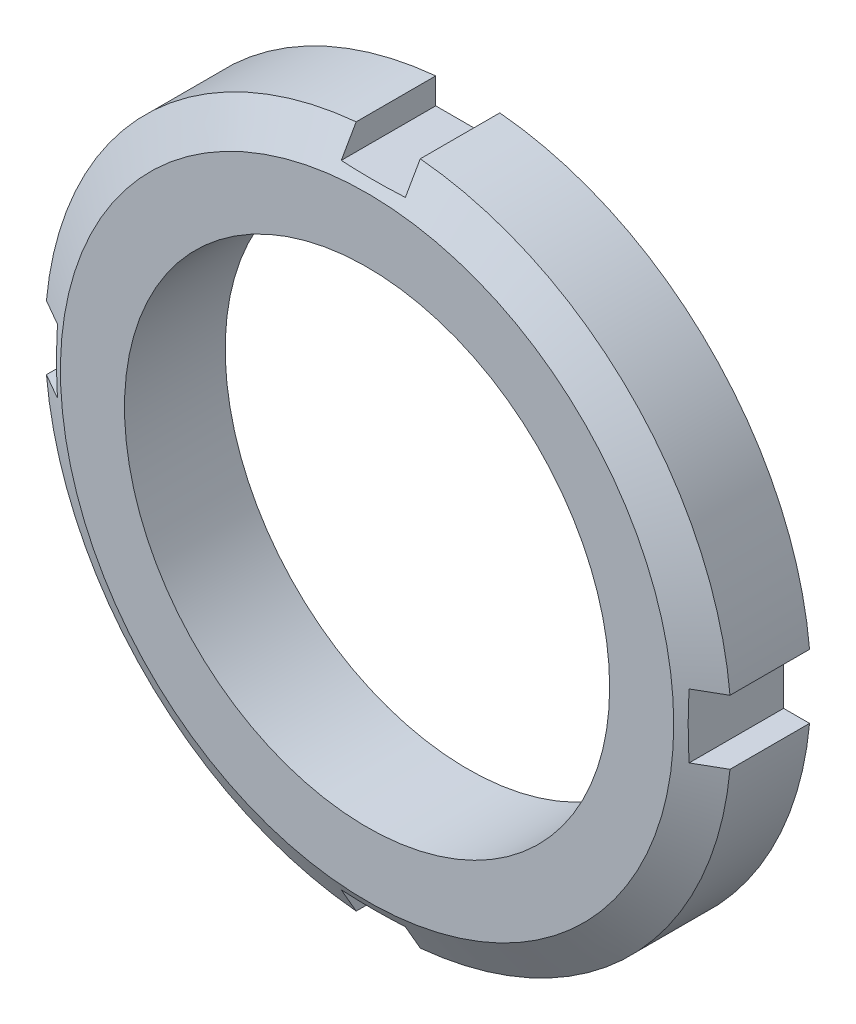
ISO-10303-21;
HEADER;
FILE_DESCRIPTION(('STEP AP214'),'2;1');
FILE_NAME('part.step','',(''),(''),'','','');
FILE_SCHEMA(('AUTOMOTIVE_DESIGN { 1 0 10303 214 1 1 1 1 }'));
ENDSEC;
DATA;
#1=APPLICATION_CONTEXT('core data for automotive mechanical design processes');
#2=APPLICATION_PROTOCOL_DEFINITION('international standard','automotive_design',2000,#1);
#3=PRODUCT_CONTEXT('',#1,'mechanical');
#4=PRODUCT('Part','Part','',(#3));
#5=PRODUCT_RELATED_PRODUCT_CATEGORY('part','',(#4));
#6=PRODUCT_DEFINITION_FORMATION('','',#4);
#7=PRODUCT_DEFINITION_CONTEXT('part definition',#1,'design');
#8=PRODUCT_DEFINITION('design','',#6,#7);
#9=PRODUCT_DEFINITION_SHAPE('','',#8);
#10=(LENGTH_UNIT() NAMED_UNIT(*) SI_UNIT(.MILLI.,.METRE.));
#11=(NAMED_UNIT(*) PLANE_ANGLE_UNIT() SI_UNIT($,.RADIAN.));
#12=(NAMED_UNIT(*) SI_UNIT($,.STERADIAN.) SOLID_ANGLE_UNIT());
#13=UNCERTAINTY_MEASURE_WITH_UNIT(LENGTH_MEASURE(1.E-05),#10,'distance_accuracy_value','');
#14=(GEOMETRIC_REPRESENTATION_CONTEXT(3) GLOBAL_UNCERTAINTY_ASSIGNED_CONTEXT((#13)) GLOBAL_UNIT_ASSIGNED_CONTEXT((#10,
#11,#12)) REPRESENTATION_CONTEXT('',''));
#15=CARTESIAN_POINT('',(0.,0.,0.));
#16=DIRECTION('',(0.,0.,1.));
#17=DIRECTION('',(1.,0.,0.));
#18=AXIS2_PLACEMENT_3D('',#15,#16,#17);
#19=CARTESIAN_POINT('',(0.,0.,11.));
#20=DIRECTION('',(0.,0.,-1.));
#21=DIRECTION('',(-1.,0.,0.));
#22=AXIS2_PLACEMENT_3D('',#19,#20,#21);
#23=CYLINDRICAL_SURFACE('',#22,37.5);
#24=CARTESIAN_POINT('',(0.,0.,8.6905989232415));
#25=DIRECTION('',(0.,0.,1.));
#26=DIRECTION('',(1.,0.,0.));
#27=AXIS2_PLACEMENT_3D('',#24,#25,#26);
#28=CIRCLE('',#27,37.5);
#29=CARTESIAN_POINT('',(-37.3363094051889,3.50000000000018,8.6905989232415));
#30=VERTEX_POINT('',#29);
#31=CARTESIAN_POINT('',(-3.49999999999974,37.336309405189,8.6905989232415));
#32=VERTEX_POINT('',#31);
#33=EDGE_CURVE('E763',#30,#32,#28,.F.);
#34=ORIENTED_EDGE('',*,*,#33,.T.);
#35=DIRECTION('',(0.,0.,-1.));
#36=VECTOR('',#35,1.);
#37=CARTESIAN_POINT('',(-3.49999999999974,37.336309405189,11.));
#38=LINE('',#37,#36);
#39=CARTESIAN_POINT('',(-3.49999999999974,37.336309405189,0.));
#40=VERTEX_POINT('',#39);
#41=EDGE_CURVE('E578',#32,#40,#38,.T.);
#42=ORIENTED_EDGE('',*,*,#41,.T.);
#43=CARTESIAN_POINT('',(0.,0.,0.));
#44=DIRECTION('',(0.,0.,1.));
#45=DIRECTION('',(1.,0.,0.));
#46=AXIS2_PLACEMENT_3D('',#43,#44,#45);
#47=CIRCLE('',#46,37.5);
#48=CARTESIAN_POINT('',(-37.3363094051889,3.50000000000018,0.));
#49=VERTEX_POINT('',#48);
#50=EDGE_CURVE('E643',#40,#49,#47,.T.);
#51=ORIENTED_EDGE('',*,*,#50,.T.);
#52=DIRECTION('',(0.,0.,-1.));
#53=VECTOR('',#52,1.);
#54=CARTESIAN_POINT('',(-37.3363094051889,3.50000000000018,11.));
#55=LINE('',#54,#53);
#56=EDGE_CURVE('E590',#49,#30,#55,.F.);
#57=ORIENTED_EDGE('',*,*,#56,.T.);
#58=EDGE_LOOP('',(#34,#42,#51,#57));
#59=FACE_BOUND('',#58,.T.);
#60=ADVANCED_FACE('F435',(#59),#23,.T.);
#61=CARTESIAN_POINT('',(-3.50000000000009,-37.3363094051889,8.6905989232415));
#62=VERTEX_POINT('',#61);
#63=CARTESIAN_POINT('',(-37.336309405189,-3.49999999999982,8.6905989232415));
#64=VERTEX_POINT('',#63);
#65=EDGE_CURVE('E651',#62,#64,#28,.F.);
#66=ORIENTED_EDGE('',*,*,#65,.T.);
#67=DIRECTION('',(0.,0.,-1.));
#68=VECTOR('',#67,1.);
#69=CARTESIAN_POINT('',(-37.336309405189,-3.49999999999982,11.));
#70=LINE('',#69,#68);
#71=CARTESIAN_POINT('',(-37.336309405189,-3.49999999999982,0.));
#72=VERTEX_POINT('',#71);
#73=EDGE_CURVE('E594',#64,#72,#70,.T.);
#74=ORIENTED_EDGE('',*,*,#73,.T.);
#75=CARTESIAN_POINT('',(-3.50000000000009,-37.3363094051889,0.));
#76=VERTEX_POINT('',#75);
#77=EDGE_CURVE('E784',#72,#76,#47,.T.);
#78=ORIENTED_EDGE('',*,*,#77,.T.);
#79=DIRECTION('',(0.,0.,-1.));
#80=VECTOR('',#79,1.);
#81=CARTESIAN_POINT('',(-3.50000000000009,-37.3363094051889,11.));
#82=LINE('',#81,#80);
#83=EDGE_CURVE('E608',#76,#62,#82,.F.);
#84=ORIENTED_EDGE('',*,*,#83,.T.);
#85=EDGE_LOOP('',(#66,#74,#78,#84));
#86=FACE_BOUND('',#85,.T.);
#87=ADVANCED_FACE('F770',(#86),#23,.T.);
#88=CARTESIAN_POINT('',(37.3363094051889,-3.5,8.6905989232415));
#89=VERTEX_POINT('',#88);
#90=CARTESIAN_POINT('',(3.49999999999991,-37.3363094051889,8.6905989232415));
#91=VERTEX_POINT('',#90);
#92=EDGE_CURVE('E647',#89,#91,#28,.F.);
#93=ORIENTED_EDGE('',*,*,#92,.T.);
#94=DIRECTION('',(0.,0.,-1.));
#95=VECTOR('',#94,1.);
#96=CARTESIAN_POINT('',(3.49999999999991,-37.3363094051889,11.));
#97=LINE('',#96,#95);
#98=CARTESIAN_POINT('',(3.49999999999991,-37.3363094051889,0.));
#99=VERTEX_POINT('',#98);
#100=EDGE_CURVE('E612',#91,#99,#97,.T.);
#101=ORIENTED_EDGE('',*,*,#100,.T.);
#102=CARTESIAN_POINT('',(37.3363094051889,-3.5,0.));
#103=VERTEX_POINT('',#102);
#104=EDGE_CURVE('E639',#99,#103,#47,.T.);
#105=ORIENTED_EDGE('',*,*,#104,.T.);
#106=DIRECTION('',(0.,0.,-1.));
#107=VECTOR('',#106,1.);
#108=CARTESIAN_POINT('',(37.3363094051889,-3.5,11.));
#109=LINE('',#108,#107);
#110=EDGE_CURVE('E626',#103,#89,#109,.F.);
#111=ORIENTED_EDGE('',*,*,#110,.T.);
#112=EDGE_LOOP('',(#93,#101,#105,#111));
#113=FACE_BOUND('',#112,.T.);
#114=ADVANCED_FACE('F789',(#113),#23,.T.);
#115=CARTESIAN_POINT('',(0.,0.,11.));
#116=DIRECTION('',(0.,0.,1.));
#117=DIRECTION('',(1.,0.,0.));
#118=AXIS2_PLACEMENT_3D('',#115,#116,#117);
#119=PLANE('',#118);
#120=CARTESIAN_POINT('',(0.,0.,11.));
#121=DIRECTION('',(0.,0.,1.));
#122=DIRECTION('',(1.,0.,0.));
#123=AXIS2_PLACEMENT_3D('',#120,#121,#122);
#124=CIRCLE('',#123,33.5);
#125=CARTESIAN_POINT('',(33.5,0.,11.));
#126=VERTEX_POINT('',#125);
#127=EDGE_CURVE('E642',#126,#126,#124,.T.);
#128=ORIENTED_EDGE('',*,*,#127,.T.);
#129=EDGE_LOOP('',(#128));
#130=FACE_BOUND('',#129,.T.);
#131=CARTESIAN_POINT('',(0.,0.,11.));
#132=DIRECTION('',(0.,0.,1.));
#133=DIRECTION('',(1.,0.,0.));
#134=AXIS2_PLACEMENT_3D('',#131,#132,#133);
#135=CIRCLE('',#134,26.5);
#136=CARTESIAN_POINT('',(26.5,0.,11.));
#137=VERTEX_POINT('',#136);
#138=EDGE_CURVE('E636',#137,#137,#135,.T.);
#139=ORIENTED_EDGE('',*,*,#138,.F.);
#140=EDGE_LOOP('',(#139));
#141=FACE_BOUND('',#140,.T.);
#142=ADVANCED_FACE('F816',(#130,#141),#119,.T.);
#143=CARTESIAN_POINT('',(0.,0.,0.));
#144=DIRECTION('',(0.,0.,1.));
#145=DIRECTION('',(1.,0.,0.));
#146=AXIS2_PLACEMENT_3D('',#143,#144,#145);
#147=PLANE('',#146);
#148=ORIENTED_EDGE('',*,*,#50,.F.);
#149=DIRECTION('',(0.,1.,0.));
#150=VECTOR('',#149,1.);
#151=CARTESIAN_POINT('',(-3.49999999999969,44.5,0.));
#152=LINE('',#151,#150);
#153=CARTESIAN_POINT('',(-3.49999999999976,34.5,0.));
#154=VERTEX_POINT('',#153);
#155=EDGE_CURVE('E559',#154,#40,#152,.T.);
#156=ORIENTED_EDGE('',*,*,#155,.F.);
#157=DIRECTION('',(-1.,0.,0.));
#158=VECTOR('',#157,1.);
#159=CARTESIAN_POINT('',(-3.49999999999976,34.5,0.));
#160=LINE('',#159,#158);
#161=CARTESIAN_POINT('',(3.50000000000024,34.5,0.));
#162=VERTEX_POINT('',#161);
#163=EDGE_CURVE('E554',#162,#154,#160,.T.);
#164=ORIENTED_EDGE('',*,*,#163,.F.);
#165=DIRECTION('',(0.,-1.,0.));
#166=VECTOR('',#165,1.);
#167=CARTESIAN_POINT('',(3.50000000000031,44.5,0.));
#168=LINE('',#167,#166);
#169=CARTESIAN_POINT('',(3.50000000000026,37.3363094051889,0.));
#170=VERTEX_POINT('',#169);
#171=EDGE_CURVE('E562',#170,#162,#168,.T.);
#172=ORIENTED_EDGE('',*,*,#171,.F.);
#173=CARTESIAN_POINT('',(37.3363094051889,3.5,0.));
#174=VERTEX_POINT('',#173);
#175=EDGE_CURVE('E640',#174,#170,#47,.T.);
#176=ORIENTED_EDGE('',*,*,#175,.F.);
#177=DIRECTION('',(1.,0.,0.));
#178=VECTOR('',#177,1.);
#179=CARTESIAN_POINT('',(44.5,3.5,0.));
#180=LINE('',#179,#178);
#181=CARTESIAN_POINT('',(34.5,3.5,0.));
#182=VERTEX_POINT('',#181);
#183=EDGE_CURVE('E621',#182,#174,#180,.T.);
#184=ORIENTED_EDGE('',*,*,#183,.F.);
#185=DIRECTION('',(0.,1.,0.));
#186=VECTOR('',#185,1.);
#187=CARTESIAN_POINT('',(34.5,3.5,0.));
#188=LINE('',#187,#186);
#189=CARTESIAN_POINT('',(34.5,-3.5,0.));
#190=VERTEX_POINT('',#189);
#191=EDGE_CURVE('E618',#190,#182,#188,.T.);
#192=ORIENTED_EDGE('',*,*,#191,.F.);
#193=DIRECTION('',(-1.,0.,0.));
#194=VECTOR('',#193,1.);
#195=CARTESIAN_POINT('',(44.5,-3.5,0.));
#196=LINE('',#195,#194);
#197=EDGE_CURVE('E615',#103,#190,#196,.T.);
#198=ORIENTED_EDGE('',*,*,#197,.F.);
#199=ORIENTED_EDGE('',*,*,#104,.F.);
#200=DIRECTION('',(0.,-1.,0.));
#201=VECTOR('',#200,1.);
#202=CARTESIAN_POINT('',(3.49999999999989,-44.5,0.));
#203=LINE('',#202,#201);
#204=CARTESIAN_POINT('',(3.49999999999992,-34.5,0.));
#205=VERTEX_POINT('',#204);
#206=EDGE_CURVE('E603',#205,#99,#203,.T.);
#207=ORIENTED_EDGE('',*,*,#206,.F.);
#208=DIRECTION('',(1.,0.,0.));
#209=VECTOR('',#208,1.);
#210=CARTESIAN_POINT('',(3.49999999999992,-34.5,0.));
#211=LINE('',#210,#209);
#212=CARTESIAN_POINT('',(-3.50000000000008,-34.5,0.));
#213=VERTEX_POINT('',#212);
#214=EDGE_CURVE('E600',#213,#205,#211,.T.);
#215=ORIENTED_EDGE('',*,*,#214,.F.);
#216=DIRECTION('',(0.,1.,0.));
#217=VECTOR('',#216,1.);
#218=CARTESIAN_POINT('',(-3.50000000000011,-44.5,0.));
#219=LINE('',#218,#217);
#220=EDGE_CURVE('E597',#76,#213,#219,.T.);
#221=ORIENTED_EDGE('',*,*,#220,.F.);
#222=ORIENTED_EDGE('',*,*,#77,.F.);
#223=DIRECTION('',(-1.,0.,0.));
#224=VECTOR('',#223,1.);
#225=CARTESIAN_POINT('',(-44.5,-3.49999999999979,0.));
#226=LINE('',#225,#224);
#227=CARTESIAN_POINT('',(-34.5,-3.49999999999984,0.));
#228=VERTEX_POINT('',#227);
#229=EDGE_CURVE('E586',#228,#72,#226,.T.);
#230=ORIENTED_EDGE('',*,*,#229,.F.);
#231=DIRECTION('',(0.,-1.,0.));
#232=VECTOR('',#231,1.);
#233=CARTESIAN_POINT('',(-34.5,-3.49999999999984,0.));
#234=LINE('',#233,#232);
#235=CARTESIAN_POINT('',(-34.5,3.50000000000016,0.));
#236=VERTEX_POINT('',#235);
#237=EDGE_CURVE('E583',#236,#228,#234,.T.);
#238=ORIENTED_EDGE('',*,*,#237,.F.);
#239=DIRECTION('',(1.,0.,0.));
#240=VECTOR('',#239,1.);
#241=CARTESIAN_POINT('',(-44.5,3.50000000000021,0.));
#242=LINE('',#241,#240);
#243=EDGE_CURVE('E581',#49,#236,#242,.T.);
#244=ORIENTED_EDGE('',*,*,#243,.F.);
#245=EDGE_LOOP('',(#148,#156,#164,#172,#176,#184,#192,#198,#199,#207,#215,#221,#222,#230,#238,#244));
#246=FACE_BOUND('',#245,.T.);
#247=CARTESIAN_POINT('',(0.,0.,0.));
#248=DIRECTION('',(0.,0.,1.));
#249=DIRECTION('',(1.,0.,0.));
#250=AXIS2_PLACEMENT_3D('',#247,#248,#249);
#251=CIRCLE('',#250,26.5);
#252=CARTESIAN_POINT('',(26.5,0.,0.));
#253=VERTEX_POINT('',#252);
#254=EDGE_CURVE('E633',#253,#253,#251,.T.);
#255=ORIENTED_EDGE('',*,*,#254,.T.);
#256=EDGE_LOOP('',(#255));
#257=FACE_BOUND('',#256,.T.);
#258=ADVANCED_FACE('F571',(#246,#257),#147,.F.);
#259=ORIENTED_EDGE('',*,*,#175,.T.);
#260=DIRECTION('',(0.,0.,-1.));
#261=VECTOR('',#260,1.);
#262=CARTESIAN_POINT('',(3.50000000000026,37.3363094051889,11.));
#263=LINE('',#262,#261);
#264=CARTESIAN_POINT('',(3.50000000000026,37.3363094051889,8.6905989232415));
#265=VERTEX_POINT('',#264);
#266=EDGE_CURVE('E565',#170,#265,#263,.F.);
#267=ORIENTED_EDGE('',*,*,#266,.T.);
#268=CARTESIAN_POINT('',(37.3363094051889,3.5,8.6905989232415));
#269=VERTEX_POINT('',#268);
#270=EDGE_CURVE('E646',#265,#269,#28,.F.);
#271=ORIENTED_EDGE('',*,*,#270,.T.);
#272=DIRECTION('',(0.,0.,-1.));
#273=VECTOR('',#272,1.);
#274=CARTESIAN_POINT('',(37.3363094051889,3.5,11.));
#275=LINE('',#274,#273);
#276=EDGE_CURVE('E630',#269,#174,#275,.T.);
#277=ORIENTED_EDGE('',*,*,#276,.T.);
#278=EDGE_LOOP('',(#259,#267,#271,#277));
#279=FACE_BOUND('',#278,.T.);
#280=ADVANCED_FACE('F437',(#279),#23,.T.);
#281=CARTESIAN_POINT('',(0.,0.,11.));
#282=DIRECTION('',(0.,0.,-1.));
#283=DIRECTION('',(-1.,0.,0.));
#284=AXIS2_PLACEMENT_3D('',#281,#282,#283);
#285=CYLINDRICAL_SURFACE('',#284,26.5);
#286=ORIENTED_EDGE('',*,*,#138,.T.);
#287=EDGE_LOOP('',(#286));
#288=FACE_BOUND('',#287,.T.);
#289=ORIENTED_EDGE('',*,*,#254,.F.);
#290=EDGE_LOOP('',(#289));
#291=FACE_BOUND('',#290,.T.);
#292=ADVANCED_FACE('F809',(#288,#291),#285,.F.);
#293=CARTESIAN_POINT('',(0.,0.,11.));
#294=DIRECTION('',(0.,0.,-1.));
#295=DIRECTION('',(-1.,0.,0.));
#296=AXIS2_PLACEMENT_3D('',#293,#294,#295);
#297=CONICAL_SURFACE('',#296,33.5,1.0471975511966);
#298=CARTESIAN_POINT('',(-3.49999999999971,42.0118932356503,6.00162861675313));
#299=CARTESIAN_POINT('',(-3.49999999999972,40.9768039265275,6.59717037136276));
#300=CARTESIAN_POINT('',(-3.49999999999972,39.9416526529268,7.19260446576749));
#301=CARTESIAN_POINT('',(-3.49999999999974,37.8711843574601,8.38318408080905));
#302=CARTESIAN_POINT('',(-3.49999999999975,36.8358673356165,8.97832960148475));
#303=CARTESIAN_POINT('',(-3.49999999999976,34.7650253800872,10.1682590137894));
#304=CARTESIAN_POINT('',(-3.49999999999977,33.7295004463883,10.7630429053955));
#305=CARTESIAN_POINT('',(-3.49999999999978,31.6581715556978,11.9521249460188));
#306=CARTESIAN_POINT('',(-3.49999999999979,30.6223675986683,12.54642309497));
#307=CARTESIAN_POINT('',(-3.4999999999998,29.586388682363,13.140416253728));
#308=B_SPLINE_CURVE_WITH_KNOTS('',3,(#298,#299,#300,#301,#302,#303,#304,#305,#306,#307),
.UNSPECIFIED.,.F.,.F.,(4,2,2,2,4),(0.,3.58255758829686,7.16511469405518,10.7476720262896,
14.3302298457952),.UNSPECIFIED.);
#309=CARTESIAN_POINT('',(-3.49999999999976,34.5,10.3204115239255));
#310=VERTEX_POINT('',#309);
#311=EDGE_CURVE('E11',#32,#310,#308,.T.);
#312=ORIENTED_EDGE('',*,*,#311,.F.);
#313=ORIENTED_EDGE('',*,*,#33,.F.);
#314=CARTESIAN_POINT('',(-30.7145568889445,3.50000000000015,12.49341431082));
#315=CARTESIAN_POINT('',(-31.7504089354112,3.50000000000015,11.8992000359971));
#316=CARTESIAN_POINT('',(-32.7861038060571,3.50000000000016,11.3047118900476));
#317=CARTESIAN_POINT('',(-34.8572413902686,3.50000000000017,10.1152967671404));
#318=CARTESIAN_POINT('',(-35.8926841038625,3.50000000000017,9.52036979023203));
#319=CARTESIAN_POINT('',(-37.9633797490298,3.50000000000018,8.33018581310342));
#320=CARTESIAN_POINT('',(-38.9986326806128,3.50000000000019,7.73492881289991));
#321=CARTESIAN_POINT('',(-41.0689863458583,3.5000000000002,6.5441499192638));
#322=CARTESIAN_POINT('',(-42.1040870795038,3.5000000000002,5.94862802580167));
#323=CARTESIAN_POINT('',(-43.1391303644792,3.50000000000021,5.35300633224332));
#324=B_SPLINE_CURVE_WITH_KNOTS('',3,(#314,#315,#316,#317,#318,#319,#320,#321,#322,#323),
.UNSPECIFIED.,.F.,.F.,(4,2,2,2,4),(0.,3.58255770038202,7.16511499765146,10.7476721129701,
14.330229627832),.UNSPECIFIED.);
#325=CARTESIAN_POINT('',(-34.5,3.50000000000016,10.3204115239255));
#326=VERTEX_POINT('',#325);
#327=EDGE_CURVE('E722',#326,#30,#324,.T.);
#328=ORIENTED_EDGE('',*,*,#327,.F.);
#329=CARTESIAN_POINT('',(-34.5000000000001,-16.9431135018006,8.15025165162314));
#330=CARTESIAN_POINT('',(-34.5000000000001,-16.3544955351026,8.30005182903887));
#331=CARTESIAN_POINT('',(-34.5000000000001,-15.7643946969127,8.44394950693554));
#332=CARTESIAN_POINT('',(-34.5000000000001,-14.5811657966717,8.71897103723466));
#333=CARTESIAN_POINT('',(-34.5000000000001,-13.9880374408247,8.85009362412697));
#334=CARTESIAN_POINT('',(-34.5000000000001,-12.203326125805,9.22298369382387));
#335=CARTESIAN_POINT('',(-34.5,-11.0072761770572,9.44405192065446));
#336=CARTESIAN_POINT('',(-34.5,-9.21360469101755,9.72720181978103));
#337=CARTESIAN_POINT('',(-34.5,-8.61966090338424,9.81310273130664));
#338=CARTESIAN_POINT('',(-34.5,-7.42966887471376,9.96875004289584));
#339=CARTESIAN_POINT('',(-34.5,-6.83362074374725,10.038497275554));
#340=CARTESIAN_POINT('',(-34.5,-5.63997535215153,10.1610912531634));
#341=CARTESIAN_POINT('',(-34.5,-5.04237863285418,10.2139432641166));
#342=CARTESIAN_POINT('',(-34.5,-3.84589437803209,10.3021980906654));
#343=CARTESIAN_POINT('',(-34.5,-3.24700684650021,10.3376009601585));
#344=CARTESIAN_POINT('',(-34.5,-2.04756032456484,10.3905913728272));
#345=CARTESIAN_POINT('',(-34.5,-1.44700017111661,10.4081526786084));
#346=CARTESIAN_POINT('',(-34.5,-0.245620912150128,10.4251624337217));
#347=CARTESIAN_POINT('',(-34.5,0.355198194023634,10.4246108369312));
#348=CARTESIAN_POINT('',(-34.5,1.55670781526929,10.4053985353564));
#349=CARTESIAN_POINT('',(-34.5,2.15739825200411,10.3867329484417));
#350=CARTESIAN_POINT('',(-34.5,3.35795665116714,10.3315046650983));
#351=CARTESIAN_POINT('',(-34.5,3.95782460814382,10.2949418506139));
#352=CARTESIAN_POINT('',(-34.5,5.16399113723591,10.2037505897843));
#353=CARTESIAN_POINT('',(-34.5,5.77027244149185,10.1488944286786));
#354=CARTESIAN_POINT('',(-34.5,6.9810305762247,10.0218644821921));
#355=CARTESIAN_POINT('',(-34.5,7.58550735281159,9.94969018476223));
#356=CARTESIAN_POINT('',(-34.5,8.79198078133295,9.78882381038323));
#357=CARTESIAN_POINT('',(-34.5,9.39397839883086,9.70013894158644));
#358=CARTESIAN_POINT('',(-34.5,10.5954089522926,9.507133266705));
#359=CARTESIAN_POINT('',(-34.5,11.194842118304,9.40281389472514));
#360=CARTESIAN_POINT('',(-34.5,11.7928736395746,9.29112025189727));
#361=B_SPLINE_CURVE_WITH_KNOTS('',3,(#329,#330,#331,#332,#333,#334,#335,#336,#337,#338,#339,
#340,#341,#342,#343,#344,#345,#346,#347,#348,#349,#350,#351,#352,#353,#354,#355,#356,#357,#358,
#359,#360),.UNSPECIFIED.,.F.,.F.,(4,2,2,2,2,2,2,2,2,2,2,2,2,2,2,4),(0.,1.82206234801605,
3.64430500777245,7.29145019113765,9.09164713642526,10.8917512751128,12.6912937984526,
14.4908307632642,16.2930102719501,18.0951943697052,19.8978643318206,21.7005461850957,
23.5265618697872,25.3526315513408,27.1779058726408,29.003012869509),.UNSPECIFIED.);
#362=CARTESIAN_POINT('',(-34.5,-3.49999999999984,10.3204115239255));
#363=VERTEX_POINT('',#362);
#364=EDGE_CURVE('E727',#363,#326,#361,.T.);
#365=ORIENTED_EDGE('',*,*,#364,.F.);
#366=CARTESIAN_POINT('',(-43.1391303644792,-3.49999999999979,5.35300633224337));
#367=CARTESIAN_POINT('',(-42.1040870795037,-3.4999999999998,5.94862802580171));
#368=CARTESIAN_POINT('',(-41.0689863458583,-3.4999999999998,6.54414991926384));
#369=CARTESIAN_POINT('',(-38.9986326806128,-3.49999999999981,7.73492881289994));
#370=CARTESIAN_POINT('',(-37.9633797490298,-3.49999999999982,8.33018581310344));
#371=CARTESIAN_POINT('',(-35.8926841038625,-3.49999999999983,9.52036979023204));
#372=CARTESIAN_POINT('',(-34.8572413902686,-3.49999999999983,10.1152967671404));
#373=CARTESIAN_POINT('',(-32.7861038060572,-3.49999999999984,11.3047118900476));
#374=CARTESIAN_POINT('',(-31.7504089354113,-3.49999999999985,11.8992000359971));
#375=CARTESIAN_POINT('',(-30.7145568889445,-3.49999999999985,12.49341431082));
#376=B_SPLINE_CURVE_WITH_KNOTS('',3,(#366,#367,#368,#369,#370,#371,#372,#373,#374,#375),
.UNSPECIFIED.,.F.,.F.,(4,2,2,2,4),(0.,3.58255751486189,7.16511463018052,10.74767192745,
14.3302296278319),.UNSPECIFIED.);
#377=EDGE_CURVE('E732',#64,#363,#376,.T.);
#378=ORIENTED_EDGE('',*,*,#377,.F.);
#379=ORIENTED_EDGE('',*,*,#65,.F.);
#380=CARTESIAN_POINT('',(-3.50000000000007,-30.7145568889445,12.49341431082));
#381=CARTESIAN_POINT('',(-3.50000000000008,-31.7504089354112,11.8992000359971));
#382=CARTESIAN_POINT('',(-3.50000000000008,-32.7861038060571,11.3047118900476));
#383=CARTESIAN_POINT('',(-3.50000000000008,-34.8572413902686,10.1152967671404));
#384=CARTESIAN_POINT('',(-3.50000000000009,-35.8926841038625,9.52036979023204));
#385=CARTESIAN_POINT('',(-3.50000000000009,-37.9633797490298,8.33018581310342));
#386=CARTESIAN_POINT('',(-3.50000000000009,-38.9986326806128,7.73492881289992));
#387=CARTESIAN_POINT('',(-3.5000000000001,-41.0689863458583,6.54414991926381));
#388=CARTESIAN_POINT('',(-3.5000000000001,-42.1040870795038,5.94862802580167));
#389=CARTESIAN_POINT('',(-3.5000000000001,-43.1391303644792,5.35300633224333));
#390=B_SPLINE_CURVE_WITH_KNOTS('',3,(#380,#381,#382,#383,#384,#385,#386,#387,#388,#389),
.UNSPECIFIED.,.F.,.F.,(4,2,2,2,4),(0.,3.582557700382,7.16511499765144,10.7476721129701,
14.330229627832),.UNSPECIFIED.);
#391=CARTESIAN_POINT('',(-3.50000000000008,-34.5,10.3204115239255));
#392=VERTEX_POINT('',#391);
#393=EDGE_CURVE('E689',#392,#62,#390,.T.);
#394=ORIENTED_EDGE('',*,*,#393,.F.);
#395=CARTESIAN_POINT('',(11.7928736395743,-34.5,9.29112025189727));
#396=CARTESIAN_POINT('',(11.1948421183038,-34.5,9.40281389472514));
#397=CARTESIAN_POINT('',(10.5954089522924,-34.5,9.507133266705));
#398=CARTESIAN_POINT('',(9.39397839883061,-34.5,9.70013894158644));
#399=CARTESIAN_POINT('',(8.7919807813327,-34.5,9.78882381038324));
#400=CARTESIAN_POINT('',(7.58550735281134,-34.5,9.94969018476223));
#401=CARTESIAN_POINT('',(6.98103057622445,-34.5,10.0218644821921));
#402=CARTESIAN_POINT('',(5.7702724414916,-34.5,10.1488944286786));
#403=CARTESIAN_POINT('',(5.16399113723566,-34.5,10.2037505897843));
#404=CARTESIAN_POINT('',(3.95782460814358,-34.5,10.2949418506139));
#405=CARTESIAN_POINT('',(3.35795665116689,-34.5,10.3315046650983));
#406=CARTESIAN_POINT('',(2.15739825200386,-34.5,10.3867329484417));
#407=CARTESIAN_POINT('',(1.55670781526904,-34.5,10.4053985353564));
#408=CARTESIAN_POINT('',(0.355198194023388,-34.5,10.4246108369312));
#409=CARTESIAN_POINT('',(-0.245620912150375,-34.5,10.4251624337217));
#410=CARTESIAN_POINT('',(-1.44700017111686,-34.5,10.4081526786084));
#411=CARTESIAN_POINT('',(-2.04756032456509,-34.5,10.3905913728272));
#412=CARTESIAN_POINT('',(-3.24700684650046,-34.5,10.3376009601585));
#413=CARTESIAN_POINT('',(-3.84589437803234,-34.5,10.3021980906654));
#414=CARTESIAN_POINT('',(-5.04237863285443,-34.5,10.2139432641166));
#415=CARTESIAN_POINT('',(-5.63997535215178,-34.5,10.1610912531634));
#416=CARTESIAN_POINT('',(-6.8336207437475,-34.5,10.038497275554));
#417=CARTESIAN_POINT('',(-7.429668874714,-34.5,9.96875004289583));
#418=CARTESIAN_POINT('',(-8.61966090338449,-34.5,9.81310273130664));
#419=CARTESIAN_POINT('',(-9.21360469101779,-34.5,9.72720181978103));
#420=CARTESIAN_POINT('',(-11.0072761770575,-34.5,9.44405192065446));
#421=CARTESIAN_POINT('',(-12.2033261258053,-34.5,9.22298369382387));
#422=CARTESIAN_POINT('',(-13.9880374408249,-34.5,8.85009362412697));
#423=CARTESIAN_POINT('',(-14.5811657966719,-34.5,8.71897103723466));
#424=CARTESIAN_POINT('',(-15.7643946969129,-34.5,8.44394950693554));
#425=CARTESIAN_POINT('',(-16.3544955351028,-34.5,8.30005182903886));
#426=CARTESIAN_POINT('',(-16.9431135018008,-34.5,8.15025165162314));
#427=B_SPLINE_CURVE_WITH_KNOTS('',3,(#395,#396,#397,#398,#399,#400,#401,#402,#403,#404,#405,
#406,#407,#408,#409,#410,#411,#412,#413,#414,#415,#416,#417,#418,#419,#420,#421,#422,#423,#424,
#425,#426),.UNSPECIFIED.,.F.,.F.,(4,2,2,2,2,2,2,2,2,2,2,2,2,2,2,4),(0.,1.82510699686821,
3.65038131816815,5.47645099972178,7.30246668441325,9.10514853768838,10.9078184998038,
12.7100025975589,14.5121821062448,16.3117190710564,18.1112615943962,19.9113657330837,
21.7115626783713,25.3587078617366,27.1809505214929,29.003012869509),.UNSPECIFIED.);
#428=CARTESIAN_POINT('',(3.49999999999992,-34.5,10.3204115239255));
#429=VERTEX_POINT('',#428);
#430=EDGE_CURVE('E694',#429,#392,#427,.T.);
#431=ORIENTED_EDGE('',*,*,#430,.F.);
#432=CARTESIAN_POINT('',(3.4999999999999,-43.1391303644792,5.35300633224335));
#433=CARTESIAN_POINT('',(3.4999999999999,-42.1040870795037,5.9486280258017));
#434=CARTESIAN_POINT('',(3.4999999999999,-41.0689863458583,6.54414991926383));
#435=CARTESIAN_POINT('',(3.49999999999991,-38.9986326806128,7.73492881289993));
#436=CARTESIAN_POINT('',(3.49999999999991,-37.9633797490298,8.33018581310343));
#437=CARTESIAN_POINT('',(3.49999999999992,-35.8926841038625,9.52036979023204));
#438=CARTESIAN_POINT('',(3.49999999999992,-34.8572413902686,10.1152967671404));
#439=CARTESIAN_POINT('',(3.49999999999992,-32.7861038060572,11.3047118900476));
#440=CARTESIAN_POINT('',(3.49999999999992,-31.7504089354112,11.8992000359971));
#441=CARTESIAN_POINT('',(3.49999999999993,-30.7145568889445,12.49341431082));
#442=B_SPLINE_CURVE_WITH_KNOTS('',3,(#432,#433,#434,#435,#436,#437,#438,#439,#440,#441),
.UNSPECIFIED.,.F.,.F.,(4,2,2,2,4),(0.,3.5825575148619,7.16511463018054,10.74767192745,
14.330229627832),.UNSPECIFIED.);
#443=EDGE_CURVE('E700',#91,#429,#442,.T.);
#444=ORIENTED_EDGE('',*,*,#443,.F.);
#445=ORIENTED_EDGE('',*,*,#92,.F.);
#446=CARTESIAN_POINT('',(29.5863886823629,-3.5,13.140416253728));
#447=CARTESIAN_POINT('',(30.6223675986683,-3.5,12.54642309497));
#448=CARTESIAN_POINT('',(31.6581715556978,-3.5,11.9521249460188));
#449=CARTESIAN_POINT('',(33.7295004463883,-3.5,10.7630429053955));
#450=CARTESIAN_POINT('',(34.7650253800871,-3.5,10.1682590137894));
#451=CARTESIAN_POINT('',(36.8358673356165,-3.5,8.97832960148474));
#452=CARTESIAN_POINT('',(37.8711843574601,-3.5,8.38318408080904));
#453=CARTESIAN_POINT('',(39.9416526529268,-3.5,7.19260446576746));
#454=CARTESIAN_POINT('',(40.9768039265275,-3.5,6.59717037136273));
#455=CARTESIAN_POINT('',(42.0118932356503,-3.5,6.0016286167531));
#456=B_SPLINE_CURVE_WITH_KNOTS('',3,(#446,#447,#448,#449,#450,#451,#452,#453,#454,#455),
.UNSPECIFIED.,.F.,.F.,(4,2,2,2,4),(0.,3.58255781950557,7.16511515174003,10.7476722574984,
14.3302298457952),.UNSPECIFIED.);
#457=CARTESIAN_POINT('',(34.5,-3.5,10.3204115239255));
#458=VERTEX_POINT('',#457);
#459=EDGE_CURVE('E650',#458,#89,#456,.T.);
#460=ORIENTED_EDGE('',*,*,#459,.F.);
#461=CARTESIAN_POINT('',(34.5,11.7928736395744,9.29112025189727));
#462=CARTESIAN_POINT('',(34.5,11.1948421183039,9.40281389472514));
#463=CARTESIAN_POINT('',(34.5,10.5954089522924,9.507133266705));
#464=CARTESIAN_POINT('',(34.5,9.3939783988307,9.70013894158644));
#465=CARTESIAN_POINT('',(34.5,8.79198078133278,9.78882381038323));
#466=CARTESIAN_POINT('',(34.5,7.58550735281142,9.94969018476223));
#467=CARTESIAN_POINT('',(34.5,6.98103057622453,10.0218644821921));
#468=CARTESIAN_POINT('',(34.5,5.77027244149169,10.1488944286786));
#469=CARTESIAN_POINT('',(34.5,5.16399113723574,10.2037505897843));
#470=CARTESIAN_POINT('',(34.5,3.95782460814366,10.2949418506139));
#471=CARTESIAN_POINT('',(34.5,3.35795665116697,10.3315046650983));
#472=CARTESIAN_POINT('',(34.5,2.15739825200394,10.3867329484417));
#473=CARTESIAN_POINT('',(34.5,1.55670781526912,10.4053985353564));
#474=CARTESIAN_POINT('',(34.5,0.355198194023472,10.4246108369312));
#475=CARTESIAN_POINT('',(34.5,-0.245620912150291,10.4251624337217));
#476=CARTESIAN_POINT('',(34.5,-1.44700017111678,10.4081526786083));
#477=CARTESIAN_POINT('',(34.5,-2.047560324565,10.3905913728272));
#478=CARTESIAN_POINT('',(34.5,-3.24700684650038,10.3376009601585));
#479=CARTESIAN_POINT('',(34.5,-3.84589437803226,10.3021980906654));
#480=CARTESIAN_POINT('',(34.5,-5.04237863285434,10.2139432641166));
#481=CARTESIAN_POINT('',(34.5,-5.63997535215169,10.1610912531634));
#482=CARTESIAN_POINT('',(34.5,-6.83362074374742,10.038497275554));
#483=CARTESIAN_POINT('',(34.5,-7.42966887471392,9.96875004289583));
#484=CARTESIAN_POINT('',(34.5,-8.6196609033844,9.81310273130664));
#485=CARTESIAN_POINT('',(34.5,-9.21360469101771,9.72720181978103));
#486=CARTESIAN_POINT('',(34.5,-11.0072761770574,9.44405192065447));
#487=CARTESIAN_POINT('',(34.5,-12.2033261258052,9.22298369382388));
#488=CARTESIAN_POINT('',(34.5,-13.9880374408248,8.85009362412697));
#489=CARTESIAN_POINT('',(34.5,-14.5811657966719,8.71897103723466));
#490=CARTESIAN_POINT('',(34.5,-15.7643946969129,8.44394950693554));
#491=CARTESIAN_POINT('',(34.5,-16.3544955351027,8.30005182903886));
#492=CARTESIAN_POINT('',(34.5,-16.9431135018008,8.15025165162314));
#493=B_SPLINE_CURVE_WITH_KNOTS('',3,(#461,#462,#463,#464,#465,#466,#467,#468,#469,#470,#471,
#472,#473,#474,#475,#476,#477,#478,#479,#480,#481,#482,#483,#484,#485,#486,#487,#488,#489,#490,
#491,#492),.UNSPECIFIED.,.F.,.F.,(4,2,2,2,2,2,2,2,2,2,2,2,2,2,2,4),(0.,1.82510699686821,
3.65038131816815,5.47645099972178,7.30246668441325,9.10514853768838,10.9078184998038,
12.7100025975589,14.5121821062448,16.3117190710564,18.1112615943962,19.9113657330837,
21.7115626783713,25.3587078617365,27.180950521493,29.003012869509),.UNSPECIFIED.);
#494=CARTESIAN_POINT('',(34.5,3.5,10.3204115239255));
#495=VERTEX_POINT('',#494);
#496=EDGE_CURVE('E657',#495,#458,#493,.T.);
#497=ORIENTED_EDGE('',*,*,#496,.F.);
#498=CARTESIAN_POINT('',(42.0118932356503,3.5,6.0016286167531));
#499=CARTESIAN_POINT('',(40.9768039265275,3.5,6.59717037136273));
#500=CARTESIAN_POINT('',(39.9416526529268,3.5,7.19260446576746));
#501=CARTESIAN_POINT('',(37.8711843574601,3.5,8.38318408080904));
#502=CARTESIAN_POINT('',(36.8358673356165,3.5,8.97832960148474));
#503=CARTESIAN_POINT('',(34.7650253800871,3.5,10.1682590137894));
#504=CARTESIAN_POINT('',(33.7295004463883,3.5,10.7630429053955));
#505=CARTESIAN_POINT('',(31.6581715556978,3.5,11.9521249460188));
#506=CARTESIAN_POINT('',(30.6223675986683,3.5,12.54642309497));
#507=CARTESIAN_POINT('',(29.5863886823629,3.5,13.140416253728));
#508=B_SPLINE_CURVE_WITH_KNOTS('',3,(#498,#499,#500,#501,#502,#503,#504,#505,#506,#507),
.UNSPECIFIED.,.F.,.F.,(4,2,2,2,4),(0.,3.58255758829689,7.16511469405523,10.7476720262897,
14.3302298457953),.UNSPECIFIED.);
#509=EDGE_CURVE('E684',#269,#495,#508,.T.);
#510=ORIENTED_EDGE('',*,*,#509,.F.);
#511=ORIENTED_EDGE('',*,*,#270,.F.);
#512=CARTESIAN_POINT('',(3.5000000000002,29.5863886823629,13.140416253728));
#513=CARTESIAN_POINT('',(3.50000000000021,30.6223675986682,12.54642309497));
#514=CARTESIAN_POINT('',(3.50000000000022,31.6581715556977,11.9521249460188));
#515=CARTESIAN_POINT('',(3.50000000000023,33.7295004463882,10.7630429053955));
#516=CARTESIAN_POINT('',(3.50000000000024,34.7650253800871,10.1682590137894));
#517=CARTESIAN_POINT('',(3.50000000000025,36.8358673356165,8.97832960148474));
#518=CARTESIAN_POINT('',(3.50000000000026,37.8711843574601,8.38318408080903));
#519=CARTESIAN_POINT('',(3.50000000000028,39.9416526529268,7.19260446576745));
#520=CARTESIAN_POINT('',(3.50000000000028,40.9768039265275,6.59717037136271));
#521=CARTESIAN_POINT('',(3.50000000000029,42.0118932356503,6.00162861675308));
#522=B_SPLINE_CURVE_WITH_KNOTS('',3,(#512,#513,#514,#515,#516,#517,#518,#519,#520,#521),
.UNSPECIFIED.,.F.,.F.,(4,2,2,2,4),(0.,3.58255781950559,7.16511515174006,10.7476722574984,
14.3302298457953),.UNSPECIFIED.);
#523=CARTESIAN_POINT('',(3.50000000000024,34.5,10.3204115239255));
#524=VERTEX_POINT('',#523);
#525=EDGE_CURVE('E737',#524,#265,#522,.T.);
#526=ORIENTED_EDGE('',*,*,#525,.F.);
#527=CARTESIAN_POINT('',(-16.9431135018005,34.5000000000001,8.15025165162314));
#528=CARTESIAN_POINT('',(-16.3544955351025,34.5000000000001,8.30005182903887));
#529=CARTESIAN_POINT('',(-15.7643946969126,34.5000000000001,8.44394950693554));
#530=CARTESIAN_POINT('',(-14.5811657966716,34.5000000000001,8.71897103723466));
#531=CARTESIAN_POINT('',(-13.9880374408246,34.5000000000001,8.85009362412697));
#532=CARTESIAN_POINT('',(-12.203326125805,34.5000000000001,9.22298369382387));
#533=CARTESIAN_POINT('',(-11.0072761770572,34.5000000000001,9.44405192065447));
#534=CARTESIAN_POINT('',(-9.21360469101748,34.5000000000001,9.72720181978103));
#535=CARTESIAN_POINT('',(-8.61966090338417,34.5000000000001,9.81310273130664));
#536=CARTESIAN_POINT('',(-7.42966887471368,34.5000000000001,9.96875004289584));
#537=CARTESIAN_POINT('',(-6.83362074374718,34.5,10.038497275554));
#538=CARTESIAN_POINT('',(-5.63997535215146,34.5,10.1610912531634));
#539=CARTESIAN_POINT('',(-5.04237863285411,34.5,10.2139432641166));
#540=CARTESIAN_POINT('',(-3.84589437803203,34.5,10.3021980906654));
#541=CARTESIAN_POINT('',(-3.24700684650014,34.5,10.3376009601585));
#542=CARTESIAN_POINT('',(-2.04756032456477,34.5,10.3905913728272));
#543=CARTESIAN_POINT('',(-1.44700017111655,34.5,10.4081526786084));
#544=CARTESIAN_POINT('',(-0.245620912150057,34.5,10.4251624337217));
#545=CARTESIAN_POINT('',(0.355198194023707,34.5,10.4246108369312));
#546=CARTESIAN_POINT('',(1.55670781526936,34.5,10.4053985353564));
#547=CARTESIAN_POINT('',(2.15739825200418,34.5,10.3867329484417));
#548=CARTESIAN_POINT('',(3.35795665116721,34.5,10.3315046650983));
#549=CARTESIAN_POINT('',(3.9578246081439,34.5,10.2949418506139));
#550=CARTESIAN_POINT('',(5.16399113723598,34.5,10.2037505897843));
#551=CARTESIAN_POINT('',(5.77027244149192,34.5,10.1488944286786));
#552=CARTESIAN_POINT('',(6.98103057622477,34.5,10.0218644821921));
#553=CARTESIAN_POINT('',(7.58550735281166,34.4999999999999,9.94969018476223));
#554=CARTESIAN_POINT('',(8.79198078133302,34.4999999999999,9.78882381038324));
#555=CARTESIAN_POINT('',(9.39397839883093,34.4999999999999,9.70013894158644));
#556=CARTESIAN_POINT('',(10.5954089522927,34.4999999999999,9.507133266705));
#557=CARTESIAN_POINT('',(11.1948421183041,34.4999999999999,9.40281389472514));
#558=CARTESIAN_POINT('',(11.7928736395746,34.4999999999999,9.29112025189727));
#559=B_SPLINE_CURVE_WITH_KNOTS('',3,(#527,#528,#529,#530,#531,#532,#533,#534,#535,#536,#537,
#538,#539,#540,#541,#542,#543,#544,#545,#546,#547,#548,#549,#550,#551,#552,#553,#554,#555,#556,
#557,#558),.UNSPECIFIED.,.F.,.F.,(4,2,2,2,2,2,2,2,2,2,2,2,2,2,2,4),(0.,1.82206234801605,
3.64430500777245,7.29145019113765,9.09164713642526,10.8917512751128,12.6912937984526,
14.4908307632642,16.2930102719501,18.0951943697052,19.8978643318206,21.7005461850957,
23.5265618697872,25.3526315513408,27.1779058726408,29.003012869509),.UNSPECIFIED.);
#560=EDGE_CURVE('E448',#310,#524,#559,.T.);
#561=ORIENTED_EDGE('',*,*,#560,.F.);
#562=EDGE_LOOP('',(#312,#313,#328,#365,#378,#379,#394,#431,#444,#445,#460,#497,#510,#511,#526,#561));
#563=FACE_BOUND('',#562,.T.);
#564=ORIENTED_EDGE('',*,*,#127,.F.);
#565=EDGE_LOOP('',(#564));
#566=FACE_BOUND('',#565,.T.);
#567=ADVANCED_FACE('F663',(#563,#566),#297,.T.);
#568=CARTESIAN_POINT('',(44.5,3.5,11.));
#569=DIRECTION('',(0.,1.,0.));
#570=DIRECTION('',(0.,0.,1.));
#571=AXIS2_PLACEMENT_3D('',#568,#569,#570);
#572=PLANE('',#571);
#573=ORIENTED_EDGE('',*,*,#509,.T.);
#574=DIRECTION('',(0.,0.,-1.));
#575=VECTOR('',#574,1.);
#576=CARTESIAN_POINT('',(34.5,3.5,11.));
#577=LINE('',#576,#575);
#578=EDGE_CURVE('E624',#495,#182,#577,.T.);
#579=ORIENTED_EDGE('',*,*,#578,.T.);
#580=ORIENTED_EDGE('',*,*,#183,.T.);
#581=ORIENTED_EDGE('',*,*,#276,.F.);
#582=EDGE_LOOP('',(#573,#579,#580,#581));
#583=FACE_BOUND('',#582,.T.);
#584=ADVANCED_FACE('F670',(#583),#572,.F.);
#585=CARTESIAN_POINT('',(44.5,-3.5,11.));
#586=DIRECTION('',(0.,-1.,0.));
#587=DIRECTION('',(1.,0.,0.));
#588=AXIS2_PLACEMENT_3D('',#585,#586,#587);
#589=PLANE('',#588);
#590=ORIENTED_EDGE('',*,*,#197,.T.);
#591=DIRECTION('',(0.,0.,-1.));
#592=VECTOR('',#591,1.);
#593=CARTESIAN_POINT('',(34.5,-3.5,11.));
#594=LINE('',#593,#592);
#595=EDGE_CURVE('E623',#458,#190,#594,.T.);
#596=ORIENTED_EDGE('',*,*,#595,.F.);
#597=ORIENTED_EDGE('',*,*,#459,.T.);
#598=ORIENTED_EDGE('',*,*,#110,.F.);
#599=EDGE_LOOP('',(#590,#596,#597,#598));
#600=FACE_BOUND('',#599,.T.);
#601=ADVANCED_FACE('F666',(#600),#589,.F.);
#602=CARTESIAN_POINT('',(34.5,3.5,11.));
#603=DIRECTION('',(-1.,0.,0.));
#604=DIRECTION('',(0.,0.,1.));
#605=AXIS2_PLACEMENT_3D('',#602,#603,#604);
#606=PLANE('',#605);
#607=ORIENTED_EDGE('',*,*,#496,.T.);
#608=ORIENTED_EDGE('',*,*,#595,.T.);
#609=ORIENTED_EDGE('',*,*,#191,.T.);
#610=ORIENTED_EDGE('',*,*,#578,.F.);
#611=EDGE_LOOP('',(#607,#608,#609,#610));
#612=FACE_BOUND('',#611,.T.);
#613=ADVANCED_FACE('F669',(#612),#606,.F.);
#614=CARTESIAN_POINT('',(3.49999999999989,-44.5,11.));
#615=DIRECTION('',(1.,0.,0.));
#616=DIRECTION('',(0.,1.,0.));
#617=AXIS2_PLACEMENT_3D('',#614,#615,#616);
#618=PLANE('',#617);
#619=ORIENTED_EDGE('',*,*,#443,.T.);
#620=DIRECTION('',(0.,0.,-1.));
#621=VECTOR('',#620,1.);
#622=CARTESIAN_POINT('',(3.49999999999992,-34.5,11.));
#623=LINE('',#622,#621);
#624=EDGE_CURVE('E606',#429,#205,#623,.T.);
#625=ORIENTED_EDGE('',*,*,#624,.T.);
#626=ORIENTED_EDGE('',*,*,#206,.T.);
#627=ORIENTED_EDGE('',*,*,#100,.F.);
#628=EDGE_LOOP('',(#619,#625,#626,#627));
#629=FACE_BOUND('',#628,.T.);
#630=ADVANCED_FACE('F675',(#629),#618,.F.);
#631=CARTESIAN_POINT('',(-3.50000000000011,-44.5,11.));
#632=DIRECTION('',(-1.,0.,0.));
#633=DIRECTION('',(0.,-1.,0.));
#634=AXIS2_PLACEMENT_3D('',#631,#632,#633);
#635=PLANE('',#634);
#636=ORIENTED_EDGE('',*,*,#220,.T.);
#637=DIRECTION('',(0.,0.,-1.));
#638=VECTOR('',#637,1.);
#639=CARTESIAN_POINT('',(-3.50000000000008,-34.5,11.));
#640=LINE('',#639,#638);
#641=EDGE_CURVE('E605',#392,#213,#640,.T.);
#642=ORIENTED_EDGE('',*,*,#641,.F.);
#643=ORIENTED_EDGE('',*,*,#393,.T.);
#644=ORIENTED_EDGE('',*,*,#83,.F.);
#645=EDGE_LOOP('',(#636,#642,#643,#644));
#646=FACE_BOUND('',#645,.T.);
#647=ADVANCED_FACE('F681',(#646),#635,.F.);
#648=CARTESIAN_POINT('',(3.49999999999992,-34.5,11.));
#649=DIRECTION('',(0.,1.,0.));
#650=DIRECTION('',(-1.,0.,0.));
#651=AXIS2_PLACEMENT_3D('',#648,#649,#650);
#652=PLANE('',#651);
#653=ORIENTED_EDGE('',*,*,#430,.T.);
#654=ORIENTED_EDGE('',*,*,#641,.T.);
#655=ORIENTED_EDGE('',*,*,#214,.T.);
#656=ORIENTED_EDGE('',*,*,#624,.F.);
#657=EDGE_LOOP('',(#653,#654,#655,#656));
#658=FACE_BOUND('',#657,.T.);
#659=ADVANCED_FACE('F706',(#658),#652,.F.);
#660=CARTESIAN_POINT('',(-44.5,-3.49999999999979,11.));
#661=DIRECTION('',(0.,-1.,0.));
#662=DIRECTION('',(1.,0.,0.));
#663=AXIS2_PLACEMENT_3D('',#660,#661,#662);
#664=PLANE('',#663);
#665=ORIENTED_EDGE('',*,*,#377,.T.);
#666=DIRECTION('',(0.,0.,-1.));
#667=VECTOR('',#666,1.);
#668=CARTESIAN_POINT('',(-34.5,-3.49999999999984,11.));
#669=LINE('',#668,#667);
#670=EDGE_CURVE('E588',#363,#228,#669,.T.);
#671=ORIENTED_EDGE('',*,*,#670,.T.);
#672=ORIENTED_EDGE('',*,*,#229,.T.);
#673=ORIENTED_EDGE('',*,*,#73,.F.);
#674=EDGE_LOOP('',(#665,#671,#672,#673));
#675=FACE_BOUND('',#674,.T.);
#676=ADVANCED_FACE('F709',(#675),#664,.F.);
#677=CARTESIAN_POINT('',(-44.5,3.50000000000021,11.));
#678=DIRECTION('',(0.,1.,0.));
#679=DIRECTION('',(-1.,0.,0.));
#680=AXIS2_PLACEMENT_3D('',#677,#678,#679);
#681=PLANE('',#680);
#682=ORIENTED_EDGE('',*,*,#243,.T.);
#683=DIRECTION('',(0.,0.,-1.));
#684=VECTOR('',#683,1.);
#685=CARTESIAN_POINT('',(-34.5,3.50000000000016,11.));
#686=LINE('',#685,#684);
#687=EDGE_CURVE('E463',#326,#236,#686,.T.);
#688=ORIENTED_EDGE('',*,*,#687,.F.);
#689=ORIENTED_EDGE('',*,*,#327,.T.);
#690=ORIENTED_EDGE('',*,*,#56,.F.);
#691=EDGE_LOOP('',(#682,#688,#689,#690));
#692=FACE_BOUND('',#691,.T.);
#693=ADVANCED_FACE('F715',(#692),#681,.F.);
#694=CARTESIAN_POINT('',(-34.5,-3.49999999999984,11.));
#695=DIRECTION('',(1.,0.,0.));
#696=DIRECTION('',(0.,1.,0.));
#697=AXIS2_PLACEMENT_3D('',#694,#695,#696);
#698=PLANE('',#697);
#699=ORIENTED_EDGE('',*,*,#364,.T.);
#700=ORIENTED_EDGE('',*,*,#687,.T.);
#701=ORIENTED_EDGE('',*,*,#237,.T.);
#702=ORIENTED_EDGE('',*,*,#670,.F.);
#703=EDGE_LOOP('',(#699,#700,#701,#702));
#704=FACE_BOUND('',#703,.T.);
#705=ADVANCED_FACE('F719',(#704),#698,.F.);
#706=CARTESIAN_POINT('',(-3.49999999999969,44.5,11.));
#707=DIRECTION('',(-1.,0.,0.));
#708=DIRECTION('',(0.,-1.,0.));
#709=AXIS2_PLACEMENT_3D('',#706,#707,#708);
#710=PLANE('',#709);
#711=ORIENTED_EDGE('',*,*,#311,.T.);
#712=DIRECTION('',(0.,0.,-1.));
#713=VECTOR('',#712,1.);
#714=CARTESIAN_POINT('',(-3.49999999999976,34.5,11.));
#715=LINE('',#714,#713);
#716=EDGE_CURVE('E558',#310,#154,#715,.T.);
#717=ORIENTED_EDGE('',*,*,#716,.T.);
#718=ORIENTED_EDGE('',*,*,#155,.T.);
#719=ORIENTED_EDGE('',*,*,#41,.F.);
#720=EDGE_LOOP('',(#711,#717,#718,#719));
#721=FACE_BOUND('',#720,.T.);
#722=ADVANCED_FACE('F748',(#721),#710,.F.);
#723=CARTESIAN_POINT('',(3.50000000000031,44.5,11.));
#724=DIRECTION('',(1.,0.,0.));
#725=DIRECTION('',(0.,1.,0.));
#726=AXIS2_PLACEMENT_3D('',#723,#724,#725);
#727=PLANE('',#726);
#728=ORIENTED_EDGE('',*,*,#171,.T.);
#729=DIRECTION('',(0.,0.,-1.));
#730=VECTOR('',#729,1.);
#731=CARTESIAN_POINT('',(3.50000000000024,34.5,11.));
#732=LINE('',#731,#730);
#733=EDGE_CURVE('E455',#524,#162,#732,.T.);
#734=ORIENTED_EDGE('',*,*,#733,.F.);
#735=ORIENTED_EDGE('',*,*,#525,.T.);
#736=ORIENTED_EDGE('',*,*,#266,.F.);
#737=EDGE_LOOP('',(#728,#734,#735,#736));
#738=FACE_BOUND('',#737,.T.);
#739=ADVANCED_FACE('F563',(#738),#727,.F.);
#740=CARTESIAN_POINT('',(-3.49999999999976,34.5,11.));
#741=DIRECTION('',(0.,-1.,0.));
#742=DIRECTION('',(1.,0.,0.));
#743=AXIS2_PLACEMENT_3D('',#740,#741,#742);
#744=PLANE('',#743);
#745=ORIENTED_EDGE('',*,*,#560,.T.);
#746=ORIENTED_EDGE('',*,*,#733,.T.);
#747=ORIENTED_EDGE('',*,*,#163,.T.);
#748=ORIENTED_EDGE('',*,*,#716,.F.);
#749=EDGE_LOOP('',(#745,#746,#747,#748));
#750=FACE_BOUND('',#749,.T.);
#751=ADVANCED_FACE('F551',(#750),#744,.F.);
#752=CLOSED_SHELL('',(#60,#87,#114,#142,#258,#280,#292,#567,#584,#601,#613,#630,#647,#659,#676,
#693,#705,#722,#739,#751));
#753=MANIFOLD_SOLID_BREP('B2',#752);
#754=ADVANCED_BREP_SHAPE_REPRESENTATION('',(#18,#753),#14);
#755=SHAPE_DEFINITION_REPRESENTATION(#9,#754);
ENDSEC;
END-ISO-10303-21;
